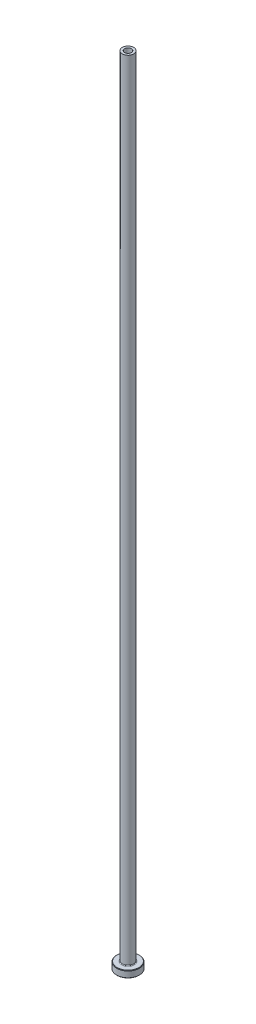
from build123d import *

# Parameters (mm, degrees)
FILLET1_R     = 0.3
CHAMFER1_SIZE = 0.2
CHAMFER3_SIZE = 0.5


with BuildPart() as part:
    # Sketch1 → Revolve1 (revolve)
    with BuildSketch(Plane.XY, mode=Mode.PRIVATE) as revolve1_sk:
        Polygon((-1.5, 350), (-2.5, 350), (-2.5, 3), (-5, 3), (-5, 0), (-1.75, 0), (-1.75, 293), (-1.5, 305), align=None)
    revolve(revolve1_sk.sketch.rotate(Axis((0, 92.187680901, 0), (0, -1, 0)), 270), axis=Axis((0, 92.187680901, 0), (0, -1, 0)))

    # Fillet1
    fillet1_edges = [part.edges().sort_by_distance(p)[0] for p in [
        (0, 3, -2.5),
    ]]
    fillet(fillet1_edges, radius=FILLET1_R)

    # Chamfer1
    chamfer1_edges = [part.edges().sort_by_distance(p)[0] for p in [
        (0, 0, -5),
        (0, 3, -5),
    ]]
    chamfer(chamfer1_edges, length=CHAMFER1_SIZE)

    # Chamfer3
    chamfer3_edges = [part.edges().sort_by_distance(p)[0] for p in [
        (0, 0, -1.75),
    ]]
    chamfer(chamfer3_edges, length=CHAMFER3_SIZE)


solid = part.part
